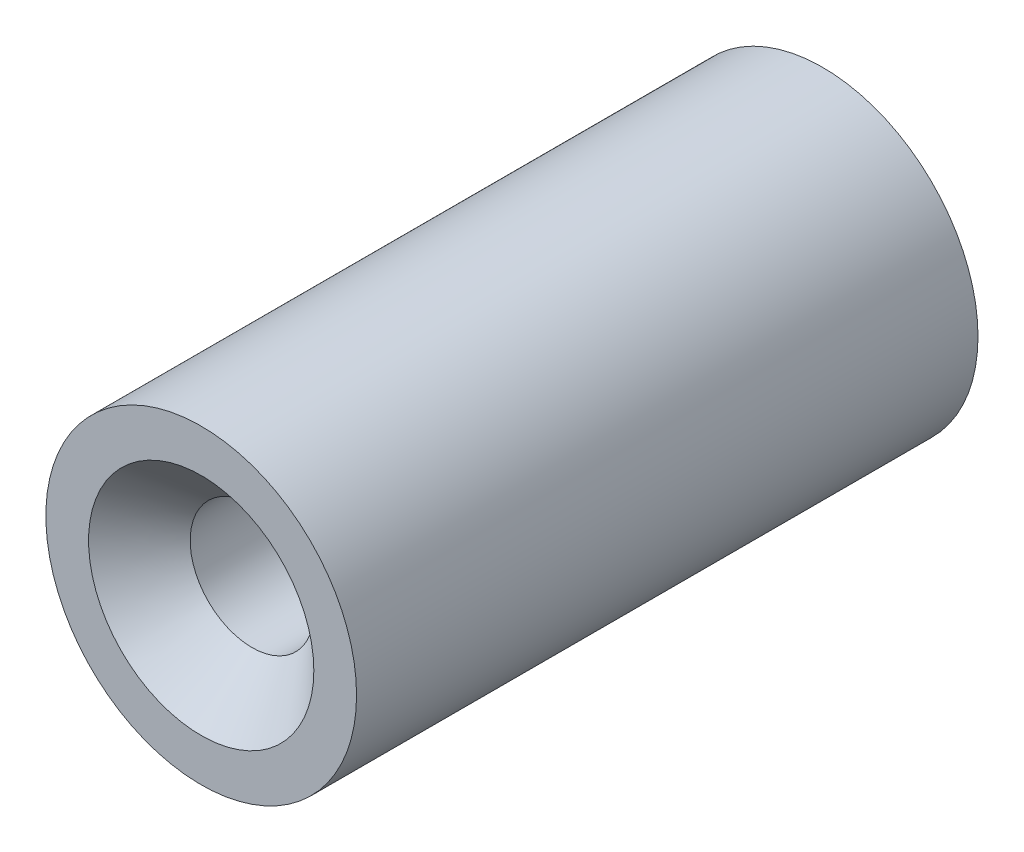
ISO-10303-21;
HEADER;
FILE_DESCRIPTION(('STEP AP214'),'2;1');
FILE_NAME('part.step','',(''),(''),'','','');
FILE_SCHEMA(('AUTOMOTIVE_DESIGN { 1 0 10303 214 1 1 1 1 }'));
ENDSEC;
DATA;
#1=APPLICATION_CONTEXT('core data for automotive mechanical design processes');
#2=APPLICATION_PROTOCOL_DEFINITION('international standard','automotive_design',2000,#1);
#3=PRODUCT_CONTEXT('',#1,'mechanical');
#4=PRODUCT('Part','Part','',(#3));
#5=PRODUCT_RELATED_PRODUCT_CATEGORY('part','',(#4));
#6=PRODUCT_DEFINITION_FORMATION('','',#4);
#7=PRODUCT_DEFINITION_CONTEXT('part definition',#1,'design');
#8=PRODUCT_DEFINITION('design','',#6,#7);
#9=PRODUCT_DEFINITION_SHAPE('','',#8);
#10=(LENGTH_UNIT() NAMED_UNIT(*) SI_UNIT(.MILLI.,.METRE.));
#11=(NAMED_UNIT(*) PLANE_ANGLE_UNIT() SI_UNIT($,.RADIAN.));
#12=(NAMED_UNIT(*) SI_UNIT($,.STERADIAN.) SOLID_ANGLE_UNIT());
#13=UNCERTAINTY_MEASURE_WITH_UNIT(LENGTH_MEASURE(1.E-05),#10,'distance_accuracy_value','');
#14=(GEOMETRIC_REPRESENTATION_CONTEXT(3) GLOBAL_UNCERTAINTY_ASSIGNED_CONTEXT((#13)) GLOBAL_UNIT_ASSIGNED_CONTEXT((#10,
#11,#12)) REPRESENTATION_CONTEXT('',''));
#15=CARTESIAN_POINT('',(0.,0.,0.));
#16=DIRECTION('',(0.,0.,1.));
#17=DIRECTION('',(1.,0.,0.));
#18=AXIS2_PLACEMENT_3D('',#15,#16,#17);
#19=CARTESIAN_POINT('',(-32.0316029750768,23.0112090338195,25.4));
#20=DIRECTION('',(0.,0.,-1.));
#21=DIRECTION('',(-1.,0.,0.));
#22=AXIS2_PLACEMENT_3D('',#19,#20,#21);
#23=CYLINDRICAL_SURFACE('',#22,6.35);
#24=CARTESIAN_POINT('',(-32.0316029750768,23.0112090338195,25.4));
#25=DIRECTION('',(0.,0.,1.));
#26=DIRECTION('',(1.,0.,0.));
#27=AXIS2_PLACEMENT_3D('',#24,#25,#26);
#28=CIRCLE('',#27,6.35);
#29=CARTESIAN_POINT('',(-25.6816029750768,23.0112090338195,25.4));
#30=VERTEX_POINT('',#29);
#31=EDGE_CURVE('E10',#30,#30,#28,.T.);
#32=ORIENTED_EDGE('',*,*,#31,.F.);
#33=EDGE_LOOP('',(#32));
#34=FACE_BOUND('',#33,.T.);
#35=CARTESIAN_POINT('',(-32.0316029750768,23.0112090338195,0.));
#36=DIRECTION('',(0.,0.,1.));
#37=DIRECTION('',(1.,0.,0.));
#38=AXIS2_PLACEMENT_3D('',#35,#36,#37);
#39=CIRCLE('',#38,6.35);
#40=CARTESIAN_POINT('',(-25.6816029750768,23.0112090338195,0.));
#41=VERTEX_POINT('',#40);
#42=EDGE_CURVE('E40',#41,#41,#39,.T.);
#43=ORIENTED_EDGE('',*,*,#42,.T.);
#44=EDGE_LOOP('',(#43));
#45=FACE_BOUND('',#44,.T.);
#46=ADVANCED_FACE('F37',(#34,#45),#23,.T.);
#47=CARTESIAN_POINT('',(-32.0316029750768,23.0112090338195,25.4));
#48=DIRECTION('',(0.,0.,1.));
#49=DIRECTION('',(1.,0.,0.));
#50=AXIS2_PLACEMENT_3D('',#47,#48,#49);
#51=PLANE('',#50);
#52=CARTESIAN_POINT('',(-32.0316029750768,23.0112090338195,25.4));
#53=DIRECTION('',(0.,0.,1.));
#54=DIRECTION('',(1.,0.,0.));
#55=AXIS2_PLACEMENT_3D('',#52,#53,#54);
#56=CIRCLE('',#55,4.60375);
#57=CARTESIAN_POINT('',(-27.4278529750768,23.0112090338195,25.4));
#58=VERTEX_POINT('',#57);
#59=EDGE_CURVE('E58',#58,#58,#56,.T.);
#60=ORIENTED_EDGE('',*,*,#59,.F.);
#61=EDGE_LOOP('',(#60));
#62=FACE_BOUND('',#61,.T.);
#63=ORIENTED_EDGE('',*,*,#31,.T.);
#64=EDGE_LOOP('',(#63));
#65=FACE_BOUND('',#64,.T.);
#66=ADVANCED_FACE('F65',(#62,#65),#51,.T.);
#67=CARTESIAN_POINT('',(-32.0316029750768,23.0112090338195,0.));
#68=DIRECTION('',(0.,0.,1.));
#69=DIRECTION('',(1.,0.,0.));
#70=AXIS2_PLACEMENT_3D('',#67,#68,#69);
#71=PLANE('',#70);
#72=CARTESIAN_POINT('',(-32.0316029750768,23.0112090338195,0.));
#73=DIRECTION('',(0.,0.,1.));
#74=DIRECTION('',(1.,0.,0.));
#75=AXIS2_PLACEMENT_3D('',#72,#73,#74);
#76=CIRCLE('',#75,2.5273);
#77=CARTESIAN_POINT('',(-29.5043029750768,23.0112090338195,0.));
#78=VERTEX_POINT('',#77);
#79=EDGE_CURVE('E49',#78,#78,#76,.T.);
#80=ORIENTED_EDGE('',*,*,#79,.T.);
#81=EDGE_LOOP('',(#80));
#82=FACE_BOUND('',#81,.T.);
#83=ORIENTED_EDGE('',*,*,#42,.F.);
#84=EDGE_LOOP('',(#83));
#85=FACE_BOUND('',#84,.T.);
#86=ADVANCED_FACE('F67',(#82,#85),#71,.F.);
#87=CARTESIAN_POINT('',(-32.0316029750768,23.0112090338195,25.4));
#88=DIRECTION('',(0.,0.,1.));
#89=DIRECTION('',(1.,0.,0.));
#90=AXIS2_PLACEMENT_3D('',#87,#88,#89);
#91=CYLINDRICAL_SURFACE('',#90,2.52729999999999);
#92=ORIENTED_EDGE('',*,*,#79,.F.);
#93=EDGE_LOOP('',(#92));
#94=FACE_BOUND('',#93,.T.);
#95=CARTESIAN_POINT('',(-32.0316029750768,23.0112090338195,23.32355));
#96=DIRECTION('',(0.,0.,1.));
#97=DIRECTION('',(1.,0.,0.));
#98=AXIS2_PLACEMENT_3D('',#95,#96,#97);
#99=CIRCLE('',#98,2.52729999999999);
#100=CARTESIAN_POINT('',(-29.5043029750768,23.0112090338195,23.32355));
#101=VERTEX_POINT('',#100);
#102=EDGE_CURVE('E54',#101,#101,#99,.T.);
#103=ORIENTED_EDGE('',*,*,#102,.T.);
#104=EDGE_LOOP('',(#103));
#105=FACE_BOUND('',#104,.T.);
#106=ADVANCED_FACE('F73',(#94,#105),#91,.F.);
#107=CARTESIAN_POINT('',(-32.0316029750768,23.0112090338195,25.4));
#108=DIRECTION('',(0.,0.,1.));
#109=DIRECTION('',(1.,0.,0.));
#110=AXIS2_PLACEMENT_3D('',#107,#108,#109);
#111=CONICAL_SURFACE('',#110,4.60375,0.785398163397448);
#112=ORIENTED_EDGE('',*,*,#102,.F.);
#113=EDGE_LOOP('',(#112));
#114=FACE_BOUND('',#113,.T.);
#115=ORIENTED_EDGE('',*,*,#59,.T.);
#116=EDGE_LOOP('',(#115));
#117=FACE_BOUND('',#116,.T.);
#118=ADVANCED_FACE('F63',(#114,#117),#111,.F.);
#119=CLOSED_SHELL('',(#46,#66,#86,#106,#118));
#120=MANIFOLD_SOLID_BREP('B2',#119);
#121=ADVANCED_BREP_SHAPE_REPRESENTATION('',(#18,#120),#14);
#122=SHAPE_DEFINITION_REPRESENTATION(#9,#121);
ENDSEC;
END-ISO-10303-21;
